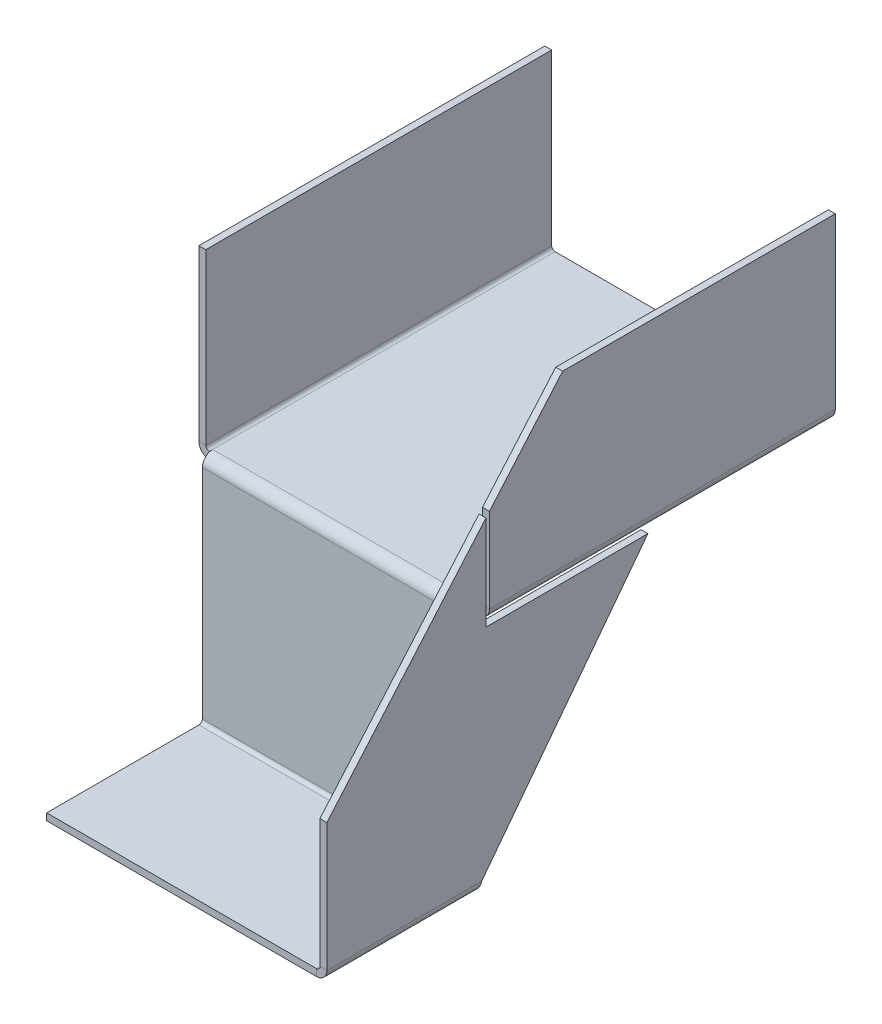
ISO-10303-21;
HEADER;
FILE_DESCRIPTION(('STEP AP214'),'2;1');
FILE_NAME('part.step','',(''),(''),'','','');
FILE_SCHEMA(('AUTOMOTIVE_DESIGN { 1 0 10303 214 1 1 1 1 }'));
ENDSEC;
DATA;
#1=APPLICATION_CONTEXT('core data for automotive mechanical design processes');
#2=APPLICATION_PROTOCOL_DEFINITION('international standard','automotive_design',2000,#1);
#3=PRODUCT_CONTEXT('',#1,'mechanical');
#4=PRODUCT('Part','Part','',(#3));
#5=PRODUCT_RELATED_PRODUCT_CATEGORY('part','',(#4));
#6=PRODUCT_DEFINITION_FORMATION('','',#4);
#7=PRODUCT_DEFINITION_CONTEXT('part definition',#1,'design');
#8=PRODUCT_DEFINITION('design','',#6,#7);
#9=PRODUCT_DEFINITION_SHAPE('','',#8);
#10=(LENGTH_UNIT() NAMED_UNIT(*) SI_UNIT(.MILLI.,.METRE.));
#11=(NAMED_UNIT(*) PLANE_ANGLE_UNIT() SI_UNIT($,.RADIAN.));
#12=(NAMED_UNIT(*) SI_UNIT($,.STERADIAN.) SOLID_ANGLE_UNIT());
#13=UNCERTAINTY_MEASURE_WITH_UNIT(LENGTH_MEASURE(1.E-05),#10,'distance_accuracy_value','');
#14=(GEOMETRIC_REPRESENTATION_CONTEXT(3) GLOBAL_UNCERTAINTY_ASSIGNED_CONTEXT((#13)) GLOBAL_UNIT_ASSIGNED_CONTEXT((#10,
#11,#12)) REPRESENTATION_CONTEXT('',''));
#15=CARTESIAN_POINT('',(0.,0.,0.));
#16=DIRECTION('',(0.,0.,1.));
#17=DIRECTION('',(1.,0.,0.));
#18=AXIS2_PLACEMENT_3D('',#15,#16,#17);
#19=CARTESIAN_POINT('',(39.,-2.,100.));
#20=DIRECTION('',(0.,0.,1.));
#21=DIRECTION('',(1.,0.,0.));
#22=AXIS2_PLACEMENT_3D('',#19,#20,#21);
#23=PLANE('',#22);
#24=DIRECTION('',(0.,1.,0.));
#25=VECTOR('',#24,1.);
#26=CARTESIAN_POINT('',(42.,0.,100.));
#27=LINE('',#26,#25);
#28=CARTESIAN_POINT('',(42.,1.,100.));
#29=VERTEX_POINT('',#28);
#30=CARTESIAN_POINT('',(42.,25.4909445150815,100.));
#31=VERTEX_POINT('',#30);
#32=EDGE_CURVE('E277',#29,#31,#27,.T.);
#33=ORIENTED_EDGE('',*,*,#32,.T.);
#34=DIRECTION('',(1.,0.,0.));
#35=VECTOR('',#34,1.);
#36=CARTESIAN_POINT('',(42.,25.4909445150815,100.));
#37=LINE('',#36,#35);
#38=CARTESIAN_POINT('',(40.,25.4909445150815,100.));
#39=VERTEX_POINT('',#38);
#40=EDGE_CURVE('E264',#31,#39,#37,.F.);
#41=ORIENTED_EDGE('',*,*,#40,.T.);
#42=DIRECTION('',(0.,1.,0.));
#43=VECTOR('',#42,1.);
#44=CARTESIAN_POINT('',(40.,0.,100.));
#45=LINE('',#44,#43);
#46=CARTESIAN_POINT('',(40.,1.,100.));
#47=VERTEX_POINT('',#46);
#48=EDGE_CURVE('E274',#47,#39,#45,.T.);
#49=ORIENTED_EDGE('',*,*,#48,.F.);
#50=DIRECTION('',(1.,0.,0.));
#51=VECTOR('',#50,1.);
#52=CARTESIAN_POINT('',(40.,1.,100.));
#53=LINE('',#52,#51);
#54=EDGE_CURVE('E387',#47,#29,#53,.T.);
#55=ORIENTED_EDGE('',*,*,#54,.T.);
#56=EDGE_LOOP('',(#33,#41,#49,#55));
#57=FACE_BOUND('',#56,.T.);
#58=ADVANCED_FACE('F65',(#57),#23,.T.);
#59=CARTESIAN_POINT('',(42.,0.,100.));
#60=DIRECTION('',(-1.,0.,0.));
#61=DIRECTION('',(0.,-1.,0.));
#62=AXIS2_PLACEMENT_3D('',#59,#60,#61);
#63=PLANE('',#62);
#64=DIRECTION('',(0.,0.756916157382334,-0.653511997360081));
#65=VECTOR('',#64,1.);
#66=CARTESIAN_POINT('',(42.,50.,78.8391862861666));
#67=LINE('',#66,#65);
#68=CARTESIAN_POINT('',(42.,50.,78.8391862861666));
#69=VERTEX_POINT('',#68);
#70=EDGE_CURVE('E269',#31,#69,#67,.T.);
#71=ORIENTED_EDGE('',*,*,#70,.F.);
#72=ORIENTED_EDGE('',*,*,#32,.F.);
#73=DIRECTION('',(0.,0.,-1.));
#74=VECTOR('',#73,1.);
#75=CARTESIAN_POINT('',(42.,1.,100.));
#76=LINE('',#75,#74);
#77=CARTESIAN_POINT('',(42.,1.,0.));
#78=VERTEX_POINT('',#77);
#79=EDGE_CURVE('E309',#29,#78,#76,.T.);
#80=ORIENTED_EDGE('',*,*,#79,.T.);
#81=DIRECTION('',(0.,1.,0.));
#82=VECTOR('',#81,1.);
#83=CARTESIAN_POINT('',(42.,0.,0.));
#84=LINE('',#83,#82);
#85=CARTESIAN_POINT('',(42.,50.,0.));
#86=VERTEX_POINT('',#85);
#87=EDGE_CURVE('E310',#78,#86,#84,.T.);
#88=ORIENTED_EDGE('',*,*,#87,.T.);
#89=DIRECTION('',(0.,0.,-1.));
#90=VECTOR('',#89,1.);
#91=CARTESIAN_POINT('',(42.,50.,100.));
#92=LINE('',#91,#90);
#93=EDGE_CURVE('E376',#69,#86,#92,.T.);
#94=ORIENTED_EDGE('',*,*,#93,.F.);
#95=EDGE_LOOP('',(#71,#72,#80,#88,#94));
#96=FACE_BOUND('',#95,.T.);
#97=ADVANCED_FACE('F567',(#96),#63,.F.);
#98=CARTESIAN_POINT('',(40.,50.,100.));
#99=DIRECTION('',(0.,1.,0.));
#100=DIRECTION('',(0.,0.,1.));
#101=AXIS2_PLACEMENT_3D('',#98,#99,#100);
#102=PLANE('',#101);
#103=DIRECTION('',(0.,0.,-1.));
#104=VECTOR('',#103,1.);
#105=CARTESIAN_POINT('',(40.,50.,100.));
#106=LINE('',#105,#104);
#107=CARTESIAN_POINT('',(40.,50.,78.8391862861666));
#108=VERTEX_POINT('',#107);
#109=CARTESIAN_POINT('',(40.,50.,0.));
#110=VERTEX_POINT('',#109);
#111=EDGE_CURVE('E374',#108,#110,#106,.T.);
#112=ORIENTED_EDGE('',*,*,#111,.F.);
#113=DIRECTION('',(1.,0.,0.));
#114=VECTOR('',#113,1.);
#115=CARTESIAN_POINT('',(42.,50.,78.8391862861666));
#116=LINE('',#115,#114);
#117=EDGE_CURVE('E82',#69,#108,#116,.F.);
#118=ORIENTED_EDGE('',*,*,#117,.F.);
#119=ORIENTED_EDGE('',*,*,#93,.T.);
#120=DIRECTION('',(1.,0.,0.));
#121=VECTOR('',#120,1.);
#122=CARTESIAN_POINT('',(40.,50.,0.));
#123=LINE('',#122,#121);
#124=EDGE_CURVE('E313',#110,#86,#123,.T.);
#125=ORIENTED_EDGE('',*,*,#124,.F.);
#126=EDGE_LOOP('',(#112,#118,#119,#125));
#127=FACE_BOUND('',#126,.T.);
#128=ADVANCED_FACE('F572',(#127),#102,.T.);
#129=CARTESIAN_POINT('',(40.,0.,100.));
#130=DIRECTION('',(-1.,0.,0.));
#131=DIRECTION('',(0.,-1.,0.));
#132=AXIS2_PLACEMENT_3D('',#129,#130,#131);
#133=PLANE('',#132);
#134=ORIENTED_EDGE('',*,*,#48,.T.);
#135=DIRECTION('',(0.,0.756916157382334,-0.653511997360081));
#136=VECTOR('',#135,1.);
#137=CARTESIAN_POINT('',(40.,50.,78.8391862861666));
#138=LINE('',#137,#136);
#139=EDGE_CURVE('E261',#39,#108,#138,.T.);
#140=ORIENTED_EDGE('',*,*,#139,.T.);
#141=ORIENTED_EDGE('',*,*,#111,.T.);
#142=DIRECTION('',(0.,1.,0.));
#143=VECTOR('',#142,1.);
#144=CARTESIAN_POINT('',(40.,0.,0.));
#145=LINE('',#144,#143);
#146=CARTESIAN_POINT('',(40.,1.,0.));
#147=VERTEX_POINT('',#146);
#148=EDGE_CURVE('E317',#147,#110,#145,.T.);
#149=ORIENTED_EDGE('',*,*,#148,.F.);
#150=DIRECTION('',(0.,0.,-1.));
#151=VECTOR('',#150,1.);
#152=CARTESIAN_POINT('',(40.,1.,100.));
#153=LINE('',#152,#151);
#154=EDGE_CURVE('E284',#47,#147,#153,.T.);
#155=ORIENTED_EDGE('',*,*,#154,.F.);
#156=EDGE_LOOP('',(#134,#140,#141,#149,#155));
#157=FACE_BOUND('',#156,.T.);
#158=ADVANCED_FACE('F281',(#157),#133,.T.);
#159=CARTESIAN_POINT('',(39.,-67.,102.));
#160=DIRECTION('',(1.,0.,0.));
#161=DIRECTION('',(0.,0.,-1.));
#162=AXIS2_PLACEMENT_3D('',#159,#160,#161);
#163=PLANE('',#162);
#164=DIRECTION('',(0.,-1.,0.));
#165=VECTOR('',#164,1.);
#166=CARTESIAN_POINT('',(39.,-67.,102.));
#167=LINE('',#166,#165);
#168=CARTESIAN_POINT('',(39.,-2.99999999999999,102.));
#169=VERTEX_POINT('',#168);
#170=CARTESIAN_POINT('',(39.,-66.,102.));
#171=VERTEX_POINT('',#170);
#172=EDGE_CURVE('E437',#169,#171,#167,.T.);
#173=ORIENTED_EDGE('',*,*,#172,.T.);
#174=DIRECTION('',(0.,0.,-1.));
#175=VECTOR('',#174,1.);
#176=CARTESIAN_POINT('',(39.,-66.,102.));
#177=LINE('',#176,#175);
#178=CARTESIAN_POINT('',(39.,-66.,100.));
#179=VERTEX_POINT('',#178);
#180=EDGE_CURVE('E467',#171,#179,#177,.T.);
#181=ORIENTED_EDGE('',*,*,#180,.T.);
#182=DIRECTION('',(0.,-1.,0.));
#183=VECTOR('',#182,1.);
#184=CARTESIAN_POINT('',(39.,-67.,100.));
#185=LINE('',#184,#183);
#186=CARTESIAN_POINT('',(39.,-3.,100.));
#187=VERTEX_POINT('',#186);
#188=EDGE_CURVE('E444',#187,#179,#185,.T.);
#189=ORIENTED_EDGE('',*,*,#188,.F.);
#190=DIRECTION('',(0.,0.,1.));
#191=VECTOR('',#190,1.);
#192=CARTESIAN_POINT('',(39.,-3.,100.));
#193=LINE('',#192,#191);
#194=EDGE_CURVE('E457',#187,#169,#193,.T.);
#195=ORIENTED_EDGE('',*,*,#194,.T.);
#196=EDGE_LOOP('',(#173,#181,#189,#195));
#197=FACE_BOUND('',#196,.T.);
#198=ADVANCED_FACE('F804',(#197),#163,.T.);
#199=CARTESIAN_POINT('',(-39.,-1.99999999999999,102.));
#200=DIRECTION('',(0.,0.,1.));
#201=DIRECTION('',(0.,-1.,0.));
#202=AXIS2_PLACEMENT_3D('',#199,#200,#201);
#203=PLANE('',#202);
#204=DIRECTION('',(0.,1.,0.));
#205=VECTOR('',#204,1.);
#206=CARTESIAN_POINT('',(-39.,-1.99999999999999,102.));
#207=LINE('',#206,#205);
#208=CARTESIAN_POINT('',(-39.,-66.,102.));
#209=VERTEX_POINT('',#208);
#210=CARTESIAN_POINT('',(-39.,-3.,102.));
#211=VERTEX_POINT('',#210);
#212=EDGE_CURVE('E434',#209,#211,#207,.T.);
#213=ORIENTED_EDGE('',*,*,#212,.F.);
#214=DIRECTION('',(1.,0.,0.));
#215=VECTOR('',#214,1.);
#216=CARTESIAN_POINT('',(39.,-66.,102.));
#217=LINE('',#216,#215);
#218=EDGE_CURVE('E478',#171,#209,#217,.F.);
#219=ORIENTED_EDGE('',*,*,#218,.F.);
#220=ORIENTED_EDGE('',*,*,#172,.F.);
#221=DIRECTION('',(-1.,0.,0.));
#222=VECTOR('',#221,1.);
#223=CARTESIAN_POINT('',(-39.,-3.,102.));
#224=LINE('',#223,#222);
#225=EDGE_CURVE('E447',#169,#211,#224,.T.);
#226=ORIENTED_EDGE('',*,*,#225,.T.);
#227=EDGE_LOOP('',(#213,#219,#220,#226));
#228=FACE_BOUND('',#227,.T.);
#229=ADVANCED_FACE('F812',(#228),#203,.T.);
#230=CARTESIAN_POINT('',(-39.,-2.,100.));
#231=DIRECTION('',(0.,0.,1.));
#232=DIRECTION('',(0.,-1.,0.));
#233=AXIS2_PLACEMENT_3D('',#230,#231,#232);
#234=PLANE('',#233);
#235=DIRECTION('',(1.,0.,0.));
#236=VECTOR('',#235,1.);
#237=CARTESIAN_POINT('',(39.,-66.,100.));
#238=LINE('',#237,#236);
#239=CARTESIAN_POINT('',(-39.,-66.,100.));
#240=VERTEX_POINT('',#239);
#241=EDGE_CURVE('E454',#179,#240,#238,.F.);
#242=ORIENTED_EDGE('',*,*,#241,.T.);
#243=DIRECTION('',(0.,1.,0.));
#244=VECTOR('',#243,1.);
#245=CARTESIAN_POINT('',(-39.,-2.,100.));
#246=LINE('',#245,#244);
#247=CARTESIAN_POINT('',(-39.,-3.,100.));
#248=VERTEX_POINT('',#247);
#249=EDGE_CURVE('E440',#240,#248,#246,.T.);
#250=ORIENTED_EDGE('',*,*,#249,.T.);
#251=DIRECTION('',(-1.,0.,0.));
#252=VECTOR('',#251,1.);
#253=CARTESIAN_POINT('',(39.,-3.,100.));
#254=LINE('',#253,#252);
#255=EDGE_CURVE('E451',#187,#248,#254,.T.);
#256=ORIENTED_EDGE('',*,*,#255,.F.);
#257=ORIENTED_EDGE('',*,*,#188,.T.);
#258=EDGE_LOOP('',(#242,#250,#256,#257));
#259=FACE_BOUND('',#258,.T.);
#260=ADVANCED_FACE('F450',(#259),#234,.F.);
#261=CARTESIAN_POINT('',(-39.,-2.,100.));
#262=DIRECTION('',(1.,0.,0.));
#263=DIRECTION('',(0.,0.,-1.));
#264=AXIS2_PLACEMENT_3D('',#261,#262,#263);
#265=PLANE('',#264);
#266=DIRECTION('',(0.,-1.,0.));
#267=VECTOR('',#266,1.);
#268=CARTESIAN_POINT('',(-39.,0.,100.));
#269=LINE('',#268,#267);
#270=CARTESIAN_POINT('',(-39.,0.,100.));
#271=VERTEX_POINT('',#270);
#272=CARTESIAN_POINT('',(-39.,-0.171572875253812,100.));
#273=VERTEX_POINT('',#272);
#274=EDGE_CURVE('E69',#271,#273,#269,.T.);
#275=ORIENTED_EDGE('',*,*,#274,.T.);
#276=CARTESIAN_POINT('',(-39.,-3.,99.));
#277=DIRECTION('',(-1.,0.,0.));
#278=DIRECTION('',(0.,0.,1.));
#279=AXIS2_PLACEMENT_3D('',#276,#277,#278);
#280=CIRCLE('',#279,3.);
#281=CARTESIAN_POINT('',(-39.,0.,99.));
#282=VERTEX_POINT('',#281);
#283=EDGE_CURVE('E13',#273,#282,#280,.T.);
#284=ORIENTED_EDGE('',*,*,#283,.T.);
#285=DIRECTION('',(0.,0.,-1.));
#286=VECTOR('',#285,1.);
#287=CARTESIAN_POINT('',(-39.,0.,100.));
#288=LINE('',#287,#286);
#289=EDGE_CURVE('E367',#271,#282,#288,.T.);
#290=ORIENTED_EDGE('',*,*,#289,.F.);
#291=EDGE_LOOP('',(#275,#284,#290));
#292=FACE_BOUND('',#291,.T.);
#293=ADVANCED_FACE('F405',(#292),#265,.T.);
#294=CARTESIAN_POINT('',(39.,-2.,99.));
#295=DIRECTION('',(-1.,0.,0.));
#296=DIRECTION('',(0.,0.,1.));
#297=AXIS2_PLACEMENT_3D('',#294,#295,#296);
#298=PLANE('',#297);
#299=DIRECTION('',(0.,0.,-1.));
#300=VECTOR('',#299,1.);
#301=CARTESIAN_POINT('',(39.,0.,100.));
#302=LINE('',#301,#300);
#303=CARTESIAN_POINT('',(39.,0.,100.));
#304=VERTEX_POINT('',#303);
#305=CARTESIAN_POINT('',(39.,0.,99.));
#306=VERTEX_POINT('',#305);
#307=EDGE_CURVE('E371',#304,#306,#302,.T.);
#308=ORIENTED_EDGE('',*,*,#307,.T.);
#309=CARTESIAN_POINT('',(39.,-3.,99.));
#310=DIRECTION('',(-1.,0.,0.));
#311=DIRECTION('',(0.,0.,1.));
#312=AXIS2_PLACEMENT_3D('',#309,#310,#311);
#313=CIRCLE('',#312,3.);
#314=CARTESIAN_POINT('',(39.,-0.171572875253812,100.));
#315=VERTEX_POINT('',#314);
#316=EDGE_CURVE('E314',#306,#315,#313,.F.);
#317=ORIENTED_EDGE('',*,*,#316,.T.);
#318=DIRECTION('',(0.,1.,0.));
#319=VECTOR('',#318,1.);
#320=CARTESIAN_POINT('',(39.,-2.,100.));
#321=LINE('',#320,#319);
#322=EDGE_CURVE('E383',#315,#304,#321,.T.);
#323=ORIENTED_EDGE('',*,*,#322,.T.);
#324=EDGE_LOOP('',(#308,#317,#323));
#325=FACE_BOUND('',#324,.T.);
#326=ADVANCED_FACE('F834',(#325),#298,.T.);
#327=CARTESIAN_POINT('',(-40.,0.,100.));
#328=DIRECTION('',(0.,1.,0.));
#329=DIRECTION('',(0.,0.,1.));
#330=AXIS2_PLACEMENT_3D('',#327,#328,#329);
#331=PLANE('',#330);
#332=CARTESIAN_POINT('',(-39.,0.,0.));
#333=VERTEX_POINT('',#332);
#334=EDGE_CURVE('E366',#282,#333,#288,.T.);
#335=ORIENTED_EDGE('',*,*,#334,.F.);
#336=DIRECTION('',(-1.,0.,0.));
#337=VECTOR('',#336,1.);
#338=CARTESIAN_POINT('',(-39.,0.,99.));
#339=LINE('',#338,#337);
#340=EDGE_CURVE('E417',#282,#306,#339,.F.);
#341=ORIENTED_EDGE('',*,*,#340,.T.);
#342=CARTESIAN_POINT('',(39.,0.,0.));
#343=VERTEX_POINT('',#342);
#344=EDGE_CURVE('E370',#306,#343,#302,.T.);
#345=ORIENTED_EDGE('',*,*,#344,.T.);
#346=DIRECTION('',(1.,0.,0.));
#347=VECTOR('',#346,1.);
#348=CARTESIAN_POINT('',(-40.,0.,0.));
#349=LINE('',#348,#347);
#350=EDGE_CURVE('E323',#333,#343,#349,.T.);
#351=ORIENTED_EDGE('',*,*,#350,.F.);
#352=EDGE_LOOP('',(#335,#341,#345,#351));
#353=FACE_BOUND('',#352,.T.);
#354=ADVANCED_FACE('F622',(#353),#331,.T.);
#355=CARTESIAN_POINT('',(-40.,-2.,100.));
#356=DIRECTION('',(0.,1.,0.));
#357=DIRECTION('',(0.,0.,1.));
#358=AXIS2_PLACEMENT_3D('',#355,#356,#357);
#359=PLANE('',#358);
#360=DIRECTION('',(-1.,0.,0.));
#361=VECTOR('',#360,1.);
#362=CARTESIAN_POINT('',(-39.,-2.,99.));
#363=LINE('',#362,#361);
#364=CARTESIAN_POINT('',(-39.,-2.,99.));
#365=VERTEX_POINT('',#364);
#366=CARTESIAN_POINT('',(39.,-2.,99.));
#367=VERTEX_POINT('',#366);
#368=EDGE_CURVE('E427',#365,#367,#363,.F.);
#369=ORIENTED_EDGE('',*,*,#368,.F.);
#370=DIRECTION('',(0.,0.,-1.));
#371=VECTOR('',#370,1.);
#372=CARTESIAN_POINT('',(-39.,-2.,100.));
#373=LINE('',#372,#371);
#374=CARTESIAN_POINT('',(-39.,-2.,0.));
#375=VERTEX_POINT('',#374);
#376=EDGE_CURVE('E352',#365,#375,#373,.T.);
#377=ORIENTED_EDGE('',*,*,#376,.T.);
#378=DIRECTION('',(1.,0.,0.));
#379=VECTOR('',#378,1.);
#380=CARTESIAN_POINT('',(-40.,-2.,0.));
#381=LINE('',#380,#379);
#382=CARTESIAN_POINT('',(39.,-2.,0.));
#383=VERTEX_POINT('',#382);
#384=EDGE_CURVE('E341',#375,#383,#381,.T.);
#385=ORIENTED_EDGE('',*,*,#384,.T.);
#386=DIRECTION('',(0.,0.,-1.));
#387=VECTOR('',#386,1.);
#388=CARTESIAN_POINT('',(39.,-2.,100.));
#389=LINE('',#388,#387);
#390=EDGE_CURVE('E348',#367,#383,#389,.T.);
#391=ORIENTED_EDGE('',*,*,#390,.F.);
#392=EDGE_LOOP('',(#369,#377,#385,#391));
#393=FACE_BOUND('',#392,.T.);
#394=ADVANCED_FACE('F592',(#393),#359,.F.);
#395=CARTESIAN_POINT('',(-39.,0.,100.));
#396=DIRECTION('',(0.,0.,1.));
#397=DIRECTION('',(1.,0.,0.));
#398=AXIS2_PLACEMENT_3D('',#395,#396,#397);
#399=PLANE('',#398);
#400=ORIENTED_EDGE('',*,*,#274,.F.);
#401=CARTESIAN_POINT('',(-39.,1.,100.));
#402=DIRECTION('',(0.,0.,-1.));
#403=DIRECTION('',(-1.,0.,0.));
#404=AXIS2_PLACEMENT_3D('',#401,#402,#403);
#405=CIRCLE('',#404,1.);
#406=CARTESIAN_POINT('',(-40.,1.,100.));
#407=VERTEX_POINT('',#406);
#408=EDGE_CURVE('E287',#407,#271,#405,.F.);
#409=ORIENTED_EDGE('',*,*,#408,.F.);
#410=DIRECTION('',(1.,0.,0.));
#411=VECTOR('',#410,1.);
#412=CARTESIAN_POINT('',(-42.,1.,100.));
#413=LINE('',#412,#411);
#414=CARTESIAN_POINT('',(-42.,1.,100.));
#415=VERTEX_POINT('',#414);
#416=EDGE_CURVE('E393',#415,#407,#413,.T.);
#417=ORIENTED_EDGE('',*,*,#416,.F.);
#418=CARTESIAN_POINT('',(-39.,1.,100.));
#419=DIRECTION('',(0.,0.,1.));
#420=DIRECTION('',(1.,0.,0.));
#421=AXIS2_PLACEMENT_3D('',#418,#419,#420);
#422=CIRCLE('',#421,3.);
#423=CARTESIAN_POINT('',(-39.,-2.,100.));
#424=VERTEX_POINT('',#423);
#425=EDGE_CURVE('E304',#415,#424,#422,.T.);
#426=ORIENTED_EDGE('',*,*,#425,.T.);
#427=EDGE_CURVE('E394',#273,#424,#269,.T.);
#428=ORIENTED_EDGE('',*,*,#427,.F.);
#429=EDGE_LOOP('',(#400,#409,#417,#426,#428));
#430=FACE_BOUND('',#429,.T.);
#431=ADVANCED_FACE('F67',(#430),#399,.T.);
#432=CARTESIAN_POINT('',(-40.,1.,0.));
#433=DIRECTION('',(0.,0.,-1.));
#434=DIRECTION('',(-1.,0.,0.));
#435=AXIS2_PLACEMENT_3D('',#432,#433,#434);
#436=PLANE('',#435);
#437=DIRECTION('',(-1.,0.,0.));
#438=VECTOR('',#437,1.);
#439=CARTESIAN_POINT('',(-40.,1.,0.));
#440=LINE('',#439,#438);
#441=CARTESIAN_POINT('',(-40.,1.,0.));
#442=VERTEX_POINT('',#441);
#443=CARTESIAN_POINT('',(-42.,1.,0.));
#444=VERTEX_POINT('',#443);
#445=EDGE_CURVE('E392',#442,#444,#440,.T.);
#446=ORIENTED_EDGE('',*,*,#445,.F.);
#447=CARTESIAN_POINT('',(-39.,1.,0.));
#448=DIRECTION('',(0.,0.,-1.));
#449=DIRECTION('',(-1.,0.,0.));
#450=AXIS2_PLACEMENT_3D('',#447,#448,#449);
#451=CIRCLE('',#450,1.);
#452=EDGE_CURVE('E326',#442,#333,#451,.F.);
#453=ORIENTED_EDGE('',*,*,#452,.T.);
#454=DIRECTION('',(0.,1.,0.));
#455=VECTOR('',#454,1.);
#456=CARTESIAN_POINT('',(-39.,-2.,0.));
#457=LINE('',#456,#455);
#458=EDGE_CURVE('E389',#375,#333,#457,.T.);
#459=ORIENTED_EDGE('',*,*,#458,.F.);
#460=CARTESIAN_POINT('',(-39.,1.,0.));
#461=DIRECTION('',(0.,0.,1.));
#462=DIRECTION('',(1.,0.,0.));
#463=AXIS2_PLACEMENT_3D('',#460,#461,#462);
#464=CIRCLE('',#463,3.);
#465=EDGE_CURVE('E338',#444,#375,#464,.T.);
#466=ORIENTED_EDGE('',*,*,#465,.F.);
#467=EDGE_LOOP('',(#446,#453,#459,#466));
#468=FACE_BOUND('',#467,.T.);
#469=ADVANCED_FACE('F585',(#468),#436,.T.);
#470=CARTESIAN_POINT('',(-39.,-2.,0.));
#471=DIRECTION('',(0.,0.,-1.));
#472=DIRECTION('',(-1.,0.,0.));
#473=AXIS2_PLACEMENT_3D('',#470,#471,#472);
#474=PLANE('',#473);
#475=DIRECTION('',(0.,-1.,0.));
#476=VECTOR('',#475,1.);
#477=CARTESIAN_POINT('',(-40.,50.,0.));
#478=LINE('',#477,#476);
#479=CARTESIAN_POINT('',(-40.,50.,0.));
#480=VERTEX_POINT('',#479);
#481=EDGE_CURVE('E329',#480,#442,#478,.T.);
#482=ORIENTED_EDGE('',*,*,#481,.T.);
#483=ORIENTED_EDGE('',*,*,#445,.T.);
#484=DIRECTION('',(0.,-1.,0.));
#485=VECTOR('',#484,1.);
#486=CARTESIAN_POINT('',(-42.,50.,0.));
#487=LINE('',#486,#485);
#488=CARTESIAN_POINT('',(-42.,50.,0.));
#489=VERTEX_POINT('',#488);
#490=EDGE_CURVE('E335',#489,#444,#487,.T.);
#491=ORIENTED_EDGE('',*,*,#490,.F.);
#492=DIRECTION('',(1.,0.,0.));
#493=VECTOR('',#492,1.);
#494=CARTESIAN_POINT('',(-42.,50.,0.));
#495=LINE('',#494,#493);
#496=EDGE_CURVE('E332',#489,#480,#495,.T.);
#497=ORIENTED_EDGE('',*,*,#496,.T.);
#498=EDGE_LOOP('',(#482,#483,#491,#497));
#499=FACE_BOUND('',#498,.T.);
#500=ADVANCED_FACE('F582',(#499),#474,.T.);
#501=CARTESIAN_POINT('',(40.,1.,100.));
#502=DIRECTION('',(0.,0.,1.));
#503=DIRECTION('',(1.,0.,0.));
#504=AXIS2_PLACEMENT_3D('',#501,#502,#503);
#505=PLANE('',#504);
#506=ORIENTED_EDGE('',*,*,#54,.F.);
#507=CARTESIAN_POINT('',(39.,1.,100.));
#508=DIRECTION('',(0.,0.,-1.));
#509=DIRECTION('',(-1.,0.,0.));
#510=AXIS2_PLACEMENT_3D('',#507,#508,#509);
#511=CIRCLE('',#510,1.);
#512=EDGE_CURVE('E285',#304,#47,#511,.F.);
#513=ORIENTED_EDGE('',*,*,#512,.F.);
#514=ORIENTED_EDGE('',*,*,#322,.F.);
#515=CARTESIAN_POINT('',(39.,-2.,100.));
#516=VERTEX_POINT('',#515);
#517=EDGE_CURVE('E384',#516,#315,#321,.T.);
#518=ORIENTED_EDGE('',*,*,#517,.F.);
#519=CARTESIAN_POINT('',(39.,1.,100.));
#520=DIRECTION('',(0.,0.,1.));
#521=DIRECTION('',(1.,0.,0.));
#522=AXIS2_PLACEMENT_3D('',#519,#520,#521);
#523=CIRCLE('',#522,3.);
#524=EDGE_CURVE('E306',#516,#29,#523,.T.);
#525=ORIENTED_EDGE('',*,*,#524,.T.);
#526=EDGE_LOOP('',(#506,#513,#514,#518,#525));
#527=FACE_BOUND('',#526,.T.);
#528=ADVANCED_FACE('F579',(#527),#505,.T.);
#529=CARTESIAN_POINT('',(39.,0.,0.));
#530=DIRECTION('',(0.,0.,-1.));
#531=DIRECTION('',(-1.,0.,0.));
#532=AXIS2_PLACEMENT_3D('',#529,#530,#531);
#533=PLANE('',#532);
#534=DIRECTION('',(0.,-1.,0.));
#535=VECTOR('',#534,1.);
#536=CARTESIAN_POINT('',(39.,0.,0.));
#537=LINE('',#536,#535);
#538=EDGE_CURVE('E380',#343,#383,#537,.T.);
#539=ORIENTED_EDGE('',*,*,#538,.F.);
#540=CARTESIAN_POINT('',(39.,1.,0.));
#541=DIRECTION('',(0.,0.,-1.));
#542=DIRECTION('',(-1.,0.,0.));
#543=AXIS2_PLACEMENT_3D('',#540,#541,#542);
#544=CIRCLE('',#543,1.);
#545=EDGE_CURVE('E320',#343,#147,#544,.F.);
#546=ORIENTED_EDGE('',*,*,#545,.T.);
#547=DIRECTION('',(-1.,0.,0.));
#548=VECTOR('',#547,1.);
#549=CARTESIAN_POINT('',(42.,1.,0.));
#550=LINE('',#549,#548);
#551=EDGE_CURVE('E378',#78,#147,#550,.T.);
#552=ORIENTED_EDGE('',*,*,#551,.F.);
#553=CARTESIAN_POINT('',(39.,1.,0.));
#554=DIRECTION('',(0.,0.,1.));
#555=DIRECTION('',(1.,0.,0.));
#556=AXIS2_PLACEMENT_3D('',#553,#554,#555);
#557=CIRCLE('',#556,3.);
#558=EDGE_CURVE('E289',#383,#78,#557,.T.);
#559=ORIENTED_EDGE('',*,*,#558,.F.);
#560=EDGE_LOOP('',(#539,#546,#552,#559));
#561=FACE_BOUND('',#560,.T.);
#562=ADVANCED_FACE('F577',(#561),#533,.T.);
#563=CARTESIAN_POINT('',(42.,1.,0.));
#564=DIRECTION('',(0.,0.,-1.));
#565=DIRECTION('',(-1.,0.,0.));
#566=AXIS2_PLACEMENT_3D('',#563,#564,#565);
#567=PLANE('',#566);
#568=ORIENTED_EDGE('',*,*,#350,.T.);
#569=ORIENTED_EDGE('',*,*,#538,.T.);
#570=ORIENTED_EDGE('',*,*,#384,.F.);
#571=ORIENTED_EDGE('',*,*,#458,.T.);
#572=EDGE_LOOP('',(#568,#569,#570,#571));
#573=FACE_BOUND('',#572,.T.);
#574=ADVANCED_FACE('F620',(#573),#567,.T.);
#575=CARTESIAN_POINT('',(39.,1.,100.));
#576=DIRECTION('',(0.,0.,-1.));
#577=DIRECTION('',(-1.,0.,0.));
#578=AXIS2_PLACEMENT_3D('',#575,#576,#577);
#579=CYLINDRICAL_SURFACE('',#578,1.);
#580=ORIENTED_EDGE('',*,*,#545,.F.);
#581=ORIENTED_EDGE('',*,*,#344,.F.);
#582=ORIENTED_EDGE('',*,*,#307,.F.);
#583=ORIENTED_EDGE('',*,*,#512,.T.);
#584=ORIENTED_EDGE('',*,*,#154,.T.);
#585=EDGE_LOOP('',(#580,#581,#582,#583,#584));
#586=FACE_BOUND('',#585,.T.);
#587=ADVANCED_FACE('F629',(#586),#579,.F.);
#588=CARTESIAN_POINT('',(-39.,1.,100.));
#589=DIRECTION('',(0.,0.,-1.));
#590=DIRECTION('',(-1.,0.,0.));
#591=AXIS2_PLACEMENT_3D('',#588,#589,#590);
#592=CYLINDRICAL_SURFACE('',#591,1.);
#593=ORIENTED_EDGE('',*,*,#452,.F.);
#594=DIRECTION('',(0.,0.,-1.));
#595=VECTOR('',#594,1.);
#596=CARTESIAN_POINT('',(-40.,1.,100.));
#597=LINE('',#596,#595);
#598=EDGE_CURVE('E363',#407,#442,#597,.T.);
#599=ORIENTED_EDGE('',*,*,#598,.F.);
#600=ORIENTED_EDGE('',*,*,#408,.T.);
#601=ORIENTED_EDGE('',*,*,#289,.T.);
#602=ORIENTED_EDGE('',*,*,#334,.T.);
#603=EDGE_LOOP('',(#593,#599,#600,#601,#602));
#604=FACE_BOUND('',#603,.T.);
#605=ADVANCED_FACE('F601',(#604),#592,.F.);
#606=CARTESIAN_POINT('',(-40.,50.,100.));
#607=DIRECTION('',(1.,0.,0.));
#608=DIRECTION('',(0.,1.,0.));
#609=AXIS2_PLACEMENT_3D('',#606,#607,#608);
#610=PLANE('',#609);
#611=ORIENTED_EDGE('',*,*,#481,.F.);
#612=DIRECTION('',(0.,0.,-1.));
#613=VECTOR('',#612,1.);
#614=CARTESIAN_POINT('',(-40.,50.,100.));
#615=LINE('',#614,#613);
#616=CARTESIAN_POINT('',(-40.,50.,100.));
#617=VERTEX_POINT('',#616);
#618=EDGE_CURVE('E361',#617,#480,#615,.T.);
#619=ORIENTED_EDGE('',*,*,#618,.F.);
#620=DIRECTION('',(0.,-1.,0.));
#621=VECTOR('',#620,1.);
#622=CARTESIAN_POINT('',(-40.,50.,100.));
#623=LINE('',#622,#621);
#624=EDGE_CURVE('E295',#617,#407,#623,.T.);
#625=ORIENTED_EDGE('',*,*,#624,.T.);
#626=ORIENTED_EDGE('',*,*,#598,.T.);
#627=EDGE_LOOP('',(#611,#619,#625,#626));
#628=FACE_BOUND('',#627,.T.);
#629=ADVANCED_FACE('F599',(#628),#610,.T.);
#630=CARTESIAN_POINT('',(-42.,50.,100.));
#631=DIRECTION('',(0.,1.,0.));
#632=DIRECTION('',(0.,0.,1.));
#633=AXIS2_PLACEMENT_3D('',#630,#631,#632);
#634=PLANE('',#633);
#635=ORIENTED_EDGE('',*,*,#496,.F.);
#636=DIRECTION('',(0.,0.,-1.));
#637=VECTOR('',#636,1.);
#638=CARTESIAN_POINT('',(-42.,50.,100.));
#639=LINE('',#638,#637);
#640=CARTESIAN_POINT('',(-42.,50.,100.));
#641=VERTEX_POINT('',#640);
#642=EDGE_CURVE('E359',#641,#489,#639,.T.);
#643=ORIENTED_EDGE('',*,*,#642,.F.);
#644=DIRECTION('',(1.,0.,0.));
#645=VECTOR('',#644,1.);
#646=CARTESIAN_POINT('',(-42.,50.,100.));
#647=LINE('',#646,#645);
#648=EDGE_CURVE('E298',#641,#617,#647,.T.);
#649=ORIENTED_EDGE('',*,*,#648,.T.);
#650=ORIENTED_EDGE('',*,*,#618,.T.);
#651=EDGE_LOOP('',(#635,#643,#649,#650));
#652=FACE_BOUND('',#651,.T.);
#653=ADVANCED_FACE('F604',(#652),#634,.T.);
#654=CARTESIAN_POINT('',(-42.,50.,100.));
#655=DIRECTION('',(1.,0.,0.));
#656=DIRECTION('',(0.,1.,0.));
#657=AXIS2_PLACEMENT_3D('',#654,#655,#656);
#658=PLANE('',#657);
#659=ORIENTED_EDGE('',*,*,#490,.T.);
#660=DIRECTION('',(0.,0.,-1.));
#661=VECTOR('',#660,1.);
#662=CARTESIAN_POINT('',(-42.,1.,100.));
#663=LINE('',#662,#661);
#664=EDGE_CURVE('E356',#415,#444,#663,.T.);
#665=ORIENTED_EDGE('',*,*,#664,.F.);
#666=DIRECTION('',(0.,-1.,0.));
#667=VECTOR('',#666,1.);
#668=CARTESIAN_POINT('',(-42.,50.,100.));
#669=LINE('',#668,#667);
#670=EDGE_CURVE('E301',#641,#415,#669,.T.);
#671=ORIENTED_EDGE('',*,*,#670,.F.);
#672=ORIENTED_EDGE('',*,*,#642,.T.);
#673=EDGE_LOOP('',(#659,#665,#671,#672));
#674=FACE_BOUND('',#673,.T.);
#675=ADVANCED_FACE('F611',(#674),#658,.F.);
#676=CARTESIAN_POINT('',(-39.,1.,100.));
#677=DIRECTION('',(0.,0.,-1.));
#678=DIRECTION('',(-1.,0.,0.));
#679=AXIS2_PLACEMENT_3D('',#676,#677,#678);
#680=CYLINDRICAL_SURFACE('',#679,3.);
#681=ORIENTED_EDGE('',*,*,#465,.T.);
#682=ORIENTED_EDGE('',*,*,#376,.F.);
#683=EDGE_CURVE('E353',#424,#365,#373,.T.);
#684=ORIENTED_EDGE('',*,*,#683,.F.);
#685=ORIENTED_EDGE('',*,*,#425,.F.);
#686=ORIENTED_EDGE('',*,*,#664,.T.);
#687=EDGE_LOOP('',(#681,#682,#684,#685,#686));
#688=FACE_BOUND('',#687,.T.);
#689=ADVANCED_FACE('F613',(#688),#680,.T.);
#690=CARTESIAN_POINT('',(39.,1.,100.));
#691=DIRECTION('',(0.,0.,-1.));
#692=DIRECTION('',(-1.,0.,0.));
#693=AXIS2_PLACEMENT_3D('',#690,#691,#692);
#694=CYLINDRICAL_SURFACE('',#693,3.);
#695=ORIENTED_EDGE('',*,*,#558,.T.);
#696=ORIENTED_EDGE('',*,*,#79,.F.);
#697=ORIENTED_EDGE('',*,*,#524,.F.);
#698=EDGE_CURVE('E349',#516,#367,#389,.T.);
#699=ORIENTED_EDGE('',*,*,#698,.T.);
#700=ORIENTED_EDGE('',*,*,#390,.T.);
#701=EDGE_LOOP('',(#695,#696,#697,#699,#700));
#702=FACE_BOUND('',#701,.T.);
#703=ADVANCED_FACE('F637',(#702),#694,.T.);
#704=CARTESIAN_POINT('',(39.,1.,100.));
#705=DIRECTION('',(0.,0.,-1.));
#706=DIRECTION('',(-1.,0.,0.));
#707=AXIS2_PLACEMENT_3D('',#704,#705,#706);
#708=PLANE('',#707);
#709=ORIENTED_EDGE('',*,*,#670,.T.);
#710=ORIENTED_EDGE('',*,*,#416,.T.);
#711=ORIENTED_EDGE('',*,*,#624,.F.);
#712=ORIENTED_EDGE('',*,*,#648,.F.);
#713=EDGE_LOOP('',(#709,#710,#711,#712));
#714=FACE_BOUND('',#713,.T.);
#715=ADVANCED_FACE('F607',(#714),#708,.F.);
#716=CARTESIAN_POINT('',(39.,1.,0.));
#717=DIRECTION('',(0.,0.,-1.));
#718=DIRECTION('',(-1.,0.,0.));
#719=AXIS2_PLACEMENT_3D('',#716,#717,#718);
#720=PLANE('',#719);
#721=ORIENTED_EDGE('',*,*,#87,.F.);
#722=ORIENTED_EDGE('',*,*,#551,.T.);
#723=ORIENTED_EDGE('',*,*,#148,.T.);
#724=ORIENTED_EDGE('',*,*,#124,.T.);
#725=EDGE_LOOP('',(#721,#722,#723,#724));
#726=FACE_BOUND('',#725,.T.);
#727=ADVANCED_FACE('F634',(#726),#720,.T.);
#728=CARTESIAN_POINT('',(39.,-3.,99.));
#729=DIRECTION('',(1.,0.,0.));
#730=DIRECTION('',(0.,0.,-1.));
#731=AXIS2_PLACEMENT_3D('',#728,#729,#730);
#732=PLANE('',#731);
#733=ORIENTED_EDGE('',*,*,#698,.F.);
#734=ORIENTED_EDGE('',*,*,#517,.T.);
#735=EDGE_CURVE('E424',#315,#169,#313,.F.);
#736=ORIENTED_EDGE('',*,*,#735,.T.);
#737=ORIENTED_EDGE('',*,*,#194,.F.);
#738=CARTESIAN_POINT('',(39.,-3.,99.));
#739=DIRECTION('',(-1.,0.,0.));
#740=DIRECTION('',(0.,0.,1.));
#741=AXIS2_PLACEMENT_3D('',#738,#739,#740);
#742=CIRCLE('',#741,1.);
#743=EDGE_CURVE('E423',#367,#187,#742,.F.);
#744=ORIENTED_EDGE('',*,*,#743,.F.);
#745=EDGE_LOOP('',(#733,#734,#736,#737,#744));
#746=FACE_BOUND('',#745,.T.);
#747=ADVANCED_FACE('F920',(#746),#732,.T.);
#748=CARTESIAN_POINT('',(-39.,-3.,99.));
#749=DIRECTION('',(1.,0.,0.));
#750=DIRECTION('',(0.,0.,-1.));
#751=AXIS2_PLACEMENT_3D('',#748,#749,#750);
#752=PLANE('',#751);
#753=EDGE_CURVE('E75',#211,#273,#280,.T.);
#754=ORIENTED_EDGE('',*,*,#753,.T.);
#755=ORIENTED_EDGE('',*,*,#427,.T.);
#756=ORIENTED_EDGE('',*,*,#683,.T.);
#757=CARTESIAN_POINT('',(-39.,-3.,99.));
#758=DIRECTION('',(-1.,0.,0.));
#759=DIRECTION('',(0.,0.,1.));
#760=AXIS2_PLACEMENT_3D('',#757,#758,#759);
#761=CIRCLE('',#760,1.);
#762=EDGE_CURVE('E432',#248,#365,#761,.T.);
#763=ORIENTED_EDGE('',*,*,#762,.F.);
#764=DIRECTION('',(0.,0.,1.));
#765=VECTOR('',#764,1.);
#766=CARTESIAN_POINT('',(-39.,-3.,100.));
#767=LINE('',#766,#765);
#768=EDGE_CURVE('E421',#248,#211,#767,.T.);
#769=ORIENTED_EDGE('',*,*,#768,.T.);
#770=EDGE_LOOP('',(#754,#755,#756,#763,#769));
#771=FACE_BOUND('',#770,.T.);
#772=ADVANCED_FACE('F418',(#771),#752,.F.);
#773=CARTESIAN_POINT('',(-39.,-3.,99.));
#774=DIRECTION('',(-1.,0.,0.));
#775=DIRECTION('',(0.,0.,1.));
#776=AXIS2_PLACEMENT_3D('',#773,#774,#775);
#777=CYLINDRICAL_SURFACE('',#776,3.);
#778=ORIENTED_EDGE('',*,*,#340,.F.);
#779=ORIENTED_EDGE('',*,*,#283,.F.);
#780=ORIENTED_EDGE('',*,*,#753,.F.);
#781=ORIENTED_EDGE('',*,*,#225,.F.);
#782=ORIENTED_EDGE('',*,*,#735,.F.);
#783=ORIENTED_EDGE('',*,*,#316,.F.);
#784=EDGE_LOOP('',(#778,#779,#780,#781,#782,#783));
#785=FACE_BOUND('',#784,.T.);
#786=ADVANCED_FACE('F412',(#785),#777,.T.);
#787=CARTESIAN_POINT('',(-39.,-3.,99.));
#788=DIRECTION('',(-1.,0.,0.));
#789=DIRECTION('',(0.,0.,1.));
#790=AXIS2_PLACEMENT_3D('',#787,#788,#789);
#791=CYLINDRICAL_SURFACE('',#790,1.);
#792=ORIENTED_EDGE('',*,*,#368,.T.);
#793=ORIENTED_EDGE('',*,*,#743,.T.);
#794=ORIENTED_EDGE('',*,*,#255,.T.);
#795=ORIENTED_EDGE('',*,*,#762,.T.);
#796=EDGE_LOOP('',(#792,#793,#794,#795));
#797=FACE_BOUND('',#796,.T.);
#798=ADVANCED_FACE('F455',(#797),#791,.F.);
#799=CARTESIAN_POINT('',(-39.,-1.99999999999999,102.));
#800=DIRECTION('',(-1.,0.,0.));
#801=DIRECTION('',(0.,0.,1.));
#802=AXIS2_PLACEMENT_3D('',#799,#800,#801);
#803=PLANE('',#802);
#804=DIRECTION('',(0.,0.,-1.));
#805=VECTOR('',#804,1.);
#806=CARTESIAN_POINT('',(-39.,-66.,102.));
#807=LINE('',#806,#805);
#808=EDGE_CURVE('E90',#209,#240,#807,.T.);
#809=ORIENTED_EDGE('',*,*,#808,.F.);
#810=ORIENTED_EDGE('',*,*,#212,.T.);
#811=ORIENTED_EDGE('',*,*,#768,.F.);
#812=ORIENTED_EDGE('',*,*,#249,.F.);
#813=EDGE_LOOP('',(#809,#810,#811,#812));
#814=FACE_BOUND('',#813,.T.);
#815=ADVANCED_FACE('F460',(#814),#803,.T.);
#816=CARTESIAN_POINT('',(-39.,-66.,103.));
#817=DIRECTION('',(-1.,0.,0.));
#818=DIRECTION('',(0.,0.,1.));
#819=AXIS2_PLACEMENT_3D('',#816,#817,#818);
#820=PLANE('',#819);
#821=DIRECTION('',(0.,-1.,0.));
#822=VECTOR('',#821,1.);
#823=CARTESIAN_POINT('',(-39.,-67.,103.));
#824=LINE('',#823,#822);
#825=CARTESIAN_POINT('',(-39.,-67.,103.));
#826=VERTEX_POINT('',#825);
#827=CARTESIAN_POINT('',(-39.,-69.,103.));
#828=VERTEX_POINT('',#827);
#829=EDGE_CURVE('E513',#826,#828,#824,.T.);
#830=ORIENTED_EDGE('',*,*,#829,.F.);
#831=CARTESIAN_POINT('',(-39.,-66.,103.));
#832=DIRECTION('',(1.,0.,0.));
#833=DIRECTION('',(0.,0.,-1.));
#834=AXIS2_PLACEMENT_3D('',#831,#832,#833);
#835=CIRCLE('',#834,1.);
#836=EDGE_CURVE('E482',#209,#826,#835,.F.);
#837=ORIENTED_EDGE('',*,*,#836,.F.);
#838=ORIENTED_EDGE('',*,*,#808,.T.);
#839=CARTESIAN_POINT('',(-39.,-66.,103.));
#840=DIRECTION('',(1.,0.,0.));
#841=DIRECTION('',(0.,0.,-1.));
#842=AXIS2_PLACEMENT_3D('',#839,#840,#841);
#843=CIRCLE('',#842,3.);
#844=EDGE_CURVE('E473',#240,#828,#843,.F.);
#845=ORIENTED_EDGE('',*,*,#844,.T.);
#846=EDGE_LOOP('',(#830,#837,#838,#845));
#847=FACE_BOUND('',#846,.T.);
#848=ADVANCED_FACE('F710',(#847),#820,.T.);
#849=CARTESIAN_POINT('',(39.,-66.,103.));
#850=DIRECTION('',(-1.,0.,0.));
#851=DIRECTION('',(0.,0.,1.));
#852=AXIS2_PLACEMENT_3D('',#849,#850,#851);
#853=PLANE('',#852);
#854=CARTESIAN_POINT('',(39.,-66.,103.));
#855=DIRECTION('',(1.,0.,0.));
#856=DIRECTION('',(0.,0.,-1.));
#857=AXIS2_PLACEMENT_3D('',#854,#855,#856);
#858=CIRCLE('',#857,1.);
#859=CARTESIAN_POINT('',(39.,-67.,103.));
#860=VERTEX_POINT('',#859);
#861=EDGE_CURVE('E475',#860,#171,#858,.T.);
#862=ORIENTED_EDGE('',*,*,#861,.F.);
#863=DIRECTION('',(0.,-1.,0.));
#864=VECTOR('',#863,1.);
#865=CARTESIAN_POINT('',(39.,-67.,103.));
#866=LINE('',#865,#864);
#867=CARTESIAN_POINT('',(39.,-69.,103.));
#868=VERTEX_POINT('',#867);
#869=EDGE_CURVE('E512',#860,#868,#866,.T.);
#870=ORIENTED_EDGE('',*,*,#869,.T.);
#871=CARTESIAN_POINT('',(39.,-66.,103.));
#872=DIRECTION('',(1.,0.,0.));
#873=DIRECTION('',(0.,0.,-1.));
#874=AXIS2_PLACEMENT_3D('',#871,#872,#873);
#875=CIRCLE('',#874,3.);
#876=EDGE_CURVE('E485',#868,#179,#875,.T.);
#877=ORIENTED_EDGE('',*,*,#876,.T.);
#878=ORIENTED_EDGE('',*,*,#180,.F.);
#879=EDGE_LOOP('',(#862,#870,#877,#878));
#880=FACE_BOUND('',#879,.T.);
#881=ADVANCED_FACE('F700',(#880),#853,.F.);
#882=CARTESIAN_POINT('',(39.,-66.,103.));
#883=DIRECTION('',(1.,0.,0.));
#884=DIRECTION('',(0.,-1.,0.));
#885=AXIS2_PLACEMENT_3D('',#882,#883,#884);
#886=CYLINDRICAL_SURFACE('',#885,3.);
#887=ORIENTED_EDGE('',*,*,#241,.F.);
#888=ORIENTED_EDGE('',*,*,#876,.F.);
#889=DIRECTION('',(-1.,0.,0.));
#890=VECTOR('',#889,1.);
#891=CARTESIAN_POINT('',(39.,-69.,103.));
#892=LINE('',#891,#890);
#893=EDGE_CURVE('E504',#868,#828,#892,.T.);
#894=ORIENTED_EDGE('',*,*,#893,.T.);
#895=ORIENTED_EDGE('',*,*,#844,.F.);
#896=EDGE_LOOP('',(#887,#888,#894,#895));
#897=FACE_BOUND('',#896,.T.);
#898=ADVANCED_FACE('F695',(#897),#886,.T.);
#899=CARTESIAN_POINT('',(39.,-66.,103.));
#900=DIRECTION('',(1.,0.,0.));
#901=DIRECTION('',(0.,-1.,0.));
#902=AXIS2_PLACEMENT_3D('',#899,#900,#901);
#903=CYLINDRICAL_SURFACE('',#902,1.);
#904=ORIENTED_EDGE('',*,*,#218,.T.);
#905=ORIENTED_EDGE('',*,*,#836,.T.);
#906=DIRECTION('',(1.,0.,0.));
#907=VECTOR('',#906,1.);
#908=CARTESIAN_POINT('',(-39.,-67.,103.));
#909=LINE('',#908,#907);
#910=EDGE_CURVE('E516',#826,#860,#909,.T.);
#911=ORIENTED_EDGE('',*,*,#910,.T.);
#912=ORIENTED_EDGE('',*,*,#861,.T.);
#913=EDGE_LOOP('',(#904,#905,#911,#912));
#914=FACE_BOUND('',#913,.T.);
#915=ADVANCED_FACE('F713',(#914),#903,.F.);
#916=CARTESIAN_POINT('',(-39.,-69.,102.));
#917=DIRECTION('',(1.,0.,0.));
#918=DIRECTION('',(0.,0.,-1.));
#919=AXIS2_PLACEMENT_3D('',#916,#917,#918);
#920=PLANE('',#919);
#921=ORIENTED_EDGE('',*,*,#829,.T.);
#922=DIRECTION('',(0.,0.,-1.));
#923=VECTOR('',#922,1.);
#924=CARTESIAN_POINT('',(-39.,-69.,102.));
#925=LINE('',#924,#923);
#926=CARTESIAN_POINT('',(-39.,-69.,147.));
#927=VERTEX_POINT('',#926);
#928=EDGE_CURVE('E495',#927,#828,#925,.T.);
#929=ORIENTED_EDGE('',*,*,#928,.F.);
#930=DIRECTION('',(0.,1.,0.));
#931=VECTOR('',#930,1.);
#932=CARTESIAN_POINT('',(-39.,-69.,147.));
#933=LINE('',#932,#931);
#934=CARTESIAN_POINT('',(-39.,-67.,147.));
#935=VERTEX_POINT('',#934);
#936=EDGE_CURVE('E492',#927,#935,#933,.T.);
#937=ORIENTED_EDGE('',*,*,#936,.T.);
#938=DIRECTION('',(0.,0.,-1.));
#939=VECTOR('',#938,1.);
#940=CARTESIAN_POINT('',(-39.,-67.,102.));
#941=LINE('',#940,#939);
#942=EDGE_CURVE('E496',#935,#826,#941,.T.);
#943=ORIENTED_EDGE('',*,*,#942,.T.);
#944=EDGE_LOOP('',(#921,#929,#937,#943));
#945=FACE_BOUND('',#944,.T.);
#946=ADVANCED_FACE('F708',(#945),#920,.F.);
#947=CARTESIAN_POINT('',(39.,-69.,102.));
#948=DIRECTION('',(0.,1.,0.));
#949=DIRECTION('',(0.,0.,1.));
#950=AXIS2_PLACEMENT_3D('',#947,#948,#949);
#951=PLANE('',#950);
#952=ORIENTED_EDGE('',*,*,#893,.F.);
#953=DIRECTION('',(0.,0.,1.));
#954=VECTOR('',#953,1.);
#955=CARTESIAN_POINT('',(39.,-69.,147.));
#956=LINE('',#955,#954);
#957=CARTESIAN_POINT('',(39.,-69.,147.));
#958=VERTEX_POINT('',#957);
#959=EDGE_CURVE('E499',#868,#958,#956,.T.);
#960=ORIENTED_EDGE('',*,*,#959,.T.);
#961=DIRECTION('',(-1.,0.,0.));
#962=VECTOR('',#961,1.);
#963=CARTESIAN_POINT('',(-39.,-69.,147.));
#964=LINE('',#963,#962);
#965=EDGE_CURVE('E507',#958,#927,#964,.T.);
#966=ORIENTED_EDGE('',*,*,#965,.T.);
#967=ORIENTED_EDGE('',*,*,#928,.T.);
#968=EDGE_LOOP('',(#952,#960,#966,#967));
#969=FACE_BOUND('',#968,.T.);
#970=ADVANCED_FACE('F703',(#969),#951,.F.);
#971=CARTESIAN_POINT('',(39.,-67.,102.));
#972=DIRECTION('',(0.,1.,0.));
#973=DIRECTION('',(0.,0.,1.));
#974=AXIS2_PLACEMENT_3D('',#971,#972,#973);
#975=PLANE('',#974);
#976=DIRECTION('',(0.,0.,1.));
#977=VECTOR('',#976,1.);
#978=CARTESIAN_POINT('',(39.,-67.,147.));
#979=LINE('',#978,#977);
#980=CARTESIAN_POINT('',(39.,-67.,147.));
#981=VERTEX_POINT('',#980);
#982=EDGE_CURVE('E502',#860,#981,#979,.T.);
#983=ORIENTED_EDGE('',*,*,#982,.F.);
#984=ORIENTED_EDGE('',*,*,#910,.F.);
#985=ORIENTED_EDGE('',*,*,#942,.F.);
#986=DIRECTION('',(-1.,0.,0.));
#987=VECTOR('',#986,1.);
#988=CARTESIAN_POINT('',(-39.,-67.,147.));
#989=LINE('',#988,#987);
#990=EDGE_CURVE('E500',#981,#935,#989,.T.);
#991=ORIENTED_EDGE('',*,*,#990,.F.);
#992=EDGE_LOOP('',(#983,#984,#985,#991));
#993=FACE_BOUND('',#992,.T.);
#994=ADVANCED_FACE('F561',(#993),#975,.T.);
#995=CARTESIAN_POINT('',(-39.,-69.,147.));
#996=DIRECTION('',(0.,0.,-1.));
#997=DIRECTION('',(0.,1.,0.));
#998=AXIS2_PLACEMENT_3D('',#995,#996,#997);
#999=PLANE('',#998);
#1000=ORIENTED_EDGE('',*,*,#990,.T.);
#1001=ORIENTED_EDGE('',*,*,#936,.F.);
#1002=ORIENTED_EDGE('',*,*,#965,.F.);
#1003=DIRECTION('',(0.,1.,0.));
#1004=VECTOR('',#1003,1.);
#1005=CARTESIAN_POINT('',(39.,-69.,147.));
#1006=LINE('',#1005,#1004);
#1007=EDGE_CURVE('E479',#958,#981,#1006,.T.);
#1008=ORIENTED_EDGE('',*,*,#1007,.T.);
#1009=EDGE_LOOP('',(#1000,#1001,#1002,#1008));
#1010=FACE_BOUND('',#1009,.T.);
#1011=ADVANCED_FACE('F554',(#1010),#999,.F.);
#1012=CARTESIAN_POINT('',(39.,-66.,147.));
#1013=DIRECTION('',(0.,0.,1.));
#1014=DIRECTION('',(1.,0.,0.));
#1015=AXIS2_PLACEMENT_3D('',#1012,#1013,#1014);
#1016=PLANE('',#1015);
#1017=DIRECTION('',(-1.,0.,0.));
#1018=VECTOR('',#1017,1.);
#1019=CARTESIAN_POINT('',(42.,-66.,147.));
#1020=LINE('',#1019,#1018);
#1021=CARTESIAN_POINT('',(40.,-66.,147.));
#1022=VERTEX_POINT('',#1021);
#1023=CARTESIAN_POINT('',(42.,-66.,147.));
#1024=VERTEX_POINT('',#1023);
#1025=EDGE_CURVE('E278',#1022,#1024,#1020,.F.);
#1026=ORIENTED_EDGE('',*,*,#1025,.F.);
#1027=CARTESIAN_POINT('',(39.,-66.,147.));
#1028=DIRECTION('',(0.,0.,-1.));
#1029=DIRECTION('',(-1.,0.,0.));
#1030=AXIS2_PLACEMENT_3D('',#1027,#1028,#1029);
#1031=CIRCLE('',#1030,0.999999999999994);
#1032=EDGE_CURVE('E530',#981,#1022,#1031,.F.);
#1033=ORIENTED_EDGE('',*,*,#1032,.F.);
#1034=ORIENTED_EDGE('',*,*,#1007,.F.);
#1035=CARTESIAN_POINT('',(39.,-66.,147.));
#1036=DIRECTION('',(0.,0.,-1.));
#1037=DIRECTION('',(-1.,0.,0.));
#1038=AXIS2_PLACEMENT_3D('',#1035,#1036,#1037);
#1039=CIRCLE('',#1038,2.99999999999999);
#1040=EDGE_CURVE('E517',#958,#1024,#1039,.F.);
#1041=ORIENTED_EDGE('',*,*,#1040,.T.);
#1042=EDGE_LOOP('',(#1026,#1033,#1034,#1041));
#1043=FACE_BOUND('',#1042,.T.);
#1044=ADVANCED_FACE('F552',(#1043),#1016,.T.);
#1045=CARTESIAN_POINT('',(42.02,-66.,102.237029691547));
#1046=CARTESIAN_POINT('',(42.02,-66.395386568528,102.300621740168));
#1047=CARTESIAN_POINT('',(41.9413974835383,-66.790478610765,102.364191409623));
#1048=CARTESIAN_POINT('',(41.6388348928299,-67.5209293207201,102.491353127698));
#1049=CARTESIAN_POINT('',(41.4149938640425,-67.8559310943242,102.554933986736));
#1050=CARTESIAN_POINT('',(40.8559310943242,-68.4149938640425,102.682095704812));
#1051=CARTESIAN_POINT('',(40.5209293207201,-68.6388348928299,102.745676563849));
#1052=CARTESIAN_POINT('',(39.790478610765,-68.9413974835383,102.872838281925));
#1053=CARTESIAN_POINT('',(39.3953865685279,-69.02,102.936407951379));
#1054=CARTESIAN_POINT('',(39.,-69.02,103.));
#1055=CARTESIAN_POINT('',(42.,-66.,102.237029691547));
#1056=CARTESIAN_POINT('',(42.,-66.3927680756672,102.300621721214));
#1057=CARTESIAN_POINT('',(41.9219180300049,-66.7852436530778,102.364191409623));
#1058=CARTESIAN_POINT('',(41.6213591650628,-67.5108569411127,102.491353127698));
#1059=CARTESIAN_POINT('',(41.3990005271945,-67.8436401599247,102.554933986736));
#1060=CARTESIAN_POINT('',(40.8436401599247,-68.3990005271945,102.682095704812));
#1061=CARTESIAN_POINT('',(40.5108569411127,-68.6213591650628,102.745676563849));
#1062=CARTESIAN_POINT('',(39.7852436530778,-68.921918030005,102.872838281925));
#1063=CARTESIAN_POINT('',(39.3927680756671,-69.,102.936407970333));
#1064=CARTESIAN_POINT('',(39.,-69.,103.));
#1065=CARTESIAN_POINT('',(40.,-66.,102.237029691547));
#1066=CARTESIAN_POINT('',(40.,-66.1309187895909,102.300619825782));
#1067=CARTESIAN_POINT('',(39.9739726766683,-66.2617478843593,102.364191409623));
#1068=CARTESIAN_POINT('',(39.8737863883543,-66.5036189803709,102.491353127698));
#1069=CARTESIAN_POINT('',(39.7996668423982,-66.6145467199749,102.554933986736));
#1070=CARTESIAN_POINT('',(39.6145467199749,-66.7996668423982,102.682095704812));
#1071=CARTESIAN_POINT('',(39.5036189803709,-66.8737863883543,102.745676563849));
#1072=CARTESIAN_POINT('',(39.2617478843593,-66.9739726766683,102.872838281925));
#1073=CARTESIAN_POINT('',(39.1309187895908,-67.,102.936409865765));
#1074=CARTESIAN_POINT('',(39.,-67.,103.));
#1075=CARTESIAN_POINT('',(39.9798,-66.,102.237029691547));
#1076=CARTESIAN_POINT('',(39.9798,-66.1282741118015,102.300619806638));
#1077=CARTESIAN_POINT('',(39.9542984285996,-66.2564605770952,102.364191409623));
#1078=CARTESIAN_POINT('',(39.8561359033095,-66.4934458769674,102.491353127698));
#1079=CARTESIAN_POINT('',(39.7835135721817,-66.6021328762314,102.554933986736));
#1080=CARTESIAN_POINT('',(39.6021328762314,-66.7835135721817,102.682095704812));
#1081=CARTESIAN_POINT('',(39.4934458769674,-66.8561359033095,102.745676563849));
#1082=CARTESIAN_POINT('',(39.2564605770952,-66.9542984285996,102.872838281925));
#1083=CARTESIAN_POINT('',(39.1282741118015,-66.9798,102.936409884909));
#1084=CARTESIAN_POINT('',(39.,-66.9798,103.));
#1085=B_SPLINE_SURFACE_WITH_KNOTS('',1,3,((#1045,#1046,#1047,#1048,#1049,#1050,#1051,#1052,
#1053,#1054),(#1055,#1056,#1057,#1058,#1059,#1060,#1061,#1062,#1063,#1064),(#1065,#1066,#1067,
#1068,#1069,#1070,#1071,#1072,#1073,#1074),(#1075,#1076,#1077,#1078,#1079,#1080,#1081,#1082,
#1083,#1084)),.UNSPECIFIED.,.F.,.F.,.F.,(2,1,1,2),(4,2,2,2,4),(-0.01,0.,1.,1.0101),(0.,0.25,0.5,
0.75,1.),.UNSPECIFIED.);
#1086=CARTESIAN_POINT('',(40.,-66.,102.237029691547));
#1087=CARTESIAN_POINT('',(40.0000010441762,-66.0313153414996,102.252241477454));
#1088=CARTESIAN_POINT('',(39.9985282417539,-66.0626171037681,102.267445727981));
#1089=CARTESIAN_POINT('',(39.9926577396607,-66.1249419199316,102.297851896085));
#1090=CARTESIAN_POINT('',(39.9882603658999,-66.1559650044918,102.313053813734));
#1091=CARTESIAN_POINT('',(39.9707348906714,-66.2481452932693,102.358628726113));
#1092=CARTESIAN_POINT('',(39.9532732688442,-66.3085212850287,102.389022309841));
#1093=CARTESIAN_POINT('',(39.9073641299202,-66.4249829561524,102.449829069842));
#1094=CARTESIAN_POINT('',(39.8789099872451,-66.4810660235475,102.480242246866));
#1095=CARTESIAN_POINT('',(39.8288084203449,-66.5604088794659,102.525819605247));
#1096=CARTESIAN_POINT('',(39.8108704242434,-66.586060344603,102.541005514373));
#1097=CARTESIAN_POINT('',(39.7726560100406,-66.6355959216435,102.571393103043));
#1098=CARTESIAN_POINT('',(39.7523773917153,-66.6594783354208,102.586594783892));
#1099=CARTESIAN_POINT('',(39.6883474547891,-66.7280661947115,102.632171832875));
#1100=CARTESIAN_POINT('',(39.6413481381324,-66.7697973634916,102.662567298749));
#1101=CARTESIAN_POINT('',(39.5403814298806,-66.8437438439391,102.723355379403));
#1102=CARTESIAN_POINT('',(39.4864141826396,-66.8759593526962,102.753747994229));
#1103=CARTESIAN_POINT('',(39.4016800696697,-66.9163173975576,102.799335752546));
#1104=CARTESIAN_POINT('',(39.3727683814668,-66.9284521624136,102.814549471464));
#1105=CARTESIAN_POINT('',(39.3139638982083,-66.9499510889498,102.844961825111));
#1106=CARTESIAN_POINT('',(39.28407196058,-66.9593176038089,102.860160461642));
#1107=CARTESIAN_POINT('',(39.1933657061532,-66.9831062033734,102.905708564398));
#1108=CARTESIAN_POINT('',(39.1313746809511,-66.9932867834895,102.93608750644));
#1109=CARTESIAN_POINT('',(39.0460629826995,-66.9992089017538,102.977625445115));
#1110=CARTESIAN_POINT('',(39.0230222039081,-67.0000079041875,102.988817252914));
#1111=CARTESIAN_POINT('',(39.,-67.,103.));
#1112=B_SPLINE_CURVE_WITH_KNOTS('',3,(#1086,#1087,#1088,#1089,#1090,#1091,#1092,#1093,#1094,
#1095,#1096,#1097,#1098,#1099,#1100,#1101,#1102,#1103,#1104,#1105,#1106,#1107,#1108,#1109,#1110,
#1111),.UNSPECIFIED.,.F.,.F.,(4,2,2,2,2,2,2,2,2,2,2,2,4),(0.,0.104381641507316,
0.208751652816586,0.4171381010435,0.6256503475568,0.729913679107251,0.834275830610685,
1.04266954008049,1.25105893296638,1.35550098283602,1.45985399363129,1.66802836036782,
1.74485271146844),.UNSPECIFIED.);
#1113=CARTESIAN_POINT('',(40.,-66.,102.237029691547));
#1114=VERTEX_POINT('',#1113);
#1115=EDGE_CURVE('E522',#1114,#860,#1112,.T.);
#1116=DIRECTION('',(-1.,0.,0.));
#1117=VECTOR('',#1116,1.);
#1118=CARTESIAN_POINT('',(40.,-66.,102.237029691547));
#1119=LINE('',#1118,#1117);
#1120=CARTESIAN_POINT('',(42.,-66.,102.237029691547));
#1121=VERTEX_POINT('',#1120);
#1122=EDGE_CURVE('E678',#1114,#1121,#1119,.F.);
#1123=CARTESIAN_POINT('',(42.,-66.,102.237029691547));
#1124=CARTESIAN_POINT('',(42.0000081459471,-66.0845585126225,102.250720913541));
#1125=CARTESIAN_POINT('',(41.9964249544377,-66.1691132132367,102.264411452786));
#1126=CARTESIAN_POINT('',(41.9821390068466,-66.3376144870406,102.291791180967));
#1127=CARTESIAN_POINT('',(41.9714366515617,-66.4215610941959,102.305480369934));
#1128=CARTESIAN_POINT('',(41.9429849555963,-66.5881997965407,102.332849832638));
#1129=CARTESIAN_POINT('',(41.9252403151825,-66.6708926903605,102.346530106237));
#1130=CARTESIAN_POINT('',(41.8828485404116,-66.8344656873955,102.373887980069));
#1131=CARTESIAN_POINT('',(41.8582014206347,-66.9153457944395,102.387565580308));
#1132=CARTESIAN_POINT('',(41.7734972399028,-67.1562128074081,102.428906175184));
#1133=CARTESIAN_POINT('',(41.7029784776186,-67.3126626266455,102.456591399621));
#1134=CARTESIAN_POINT('',(41.5364079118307,-67.6111756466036,102.511937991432));
#1135=CARTESIAN_POINT('',(41.4403604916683,-67.7532413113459,102.539599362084));
#1136=CARTESIAN_POINT('',(41.2255015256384,-68.0189903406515,102.59492960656));
#1137=CARTESIAN_POINT('',(41.1066905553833,-68.1426741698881,102.622598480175));
#1138=CARTESIAN_POINT('',(40.8497349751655,-68.3680571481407,102.67793849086));
#1139=CARTESIAN_POINT('',(40.7115860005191,-68.4697513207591,102.705609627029));
#1140=CARTESIAN_POINT('',(40.4199874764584,-68.6481825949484,102.760958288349));
#1141=CARTESIAN_POINT('',(40.2665342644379,-68.7249137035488,102.788635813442));
#1142=CARTESIAN_POINT('',(39.9488541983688,-68.8511112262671,102.843981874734));
#1143=CARTESIAN_POINT('',(39.7846350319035,-68.9005968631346,102.871650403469));
#1144=CARTESIAN_POINT('',(39.5159811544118,-68.9571202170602,102.916098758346));
#1145=CARTESIAN_POINT('',(39.4133637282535,-68.9731943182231,102.93289244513));
#1146=CARTESIAN_POINT('',(39.2071790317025,-68.9946299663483,102.966454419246));
#1147=CARTESIAN_POINT('',(39.1036135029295,-69.0000082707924,102.983222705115));
#1148=CARTESIAN_POINT('',(39.,-69.,103.));
#1149=B_SPLINE_CURVE_WITH_KNOTS('',3,(#1123,#1124,#1125,#1126,#1127,#1128,#1129,#1130,#1131,
#1132,#1133,#1134,#1135,#1136,#1137,#1138,#1139,#1140,#1141,#1142,#1143,#1144,#1145,#1146,#1147,
#1148),.UNSPECIFIED.,.F.,.F.,(4,2,2,2,2,2,2,2,2,2,2,2,4),(0.,0.25689731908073,0.513780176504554,
0.770491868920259,1.02720301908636,1.54599354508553,2.06469505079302,2.58338344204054,
3.10218909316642,3.6211192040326,4.13968271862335,4.45483243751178,4.76948801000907),.UNSPECIFIED.);
#1150=EDGE_CURVE('E532',#1121,#868,#1149,.T.);
#1151=ORIENTED_EDGE('',*,*,#1115,.F.);
#1152=ORIENTED_EDGE('',*,*,#1122,.T.);
#1153=ORIENTED_EDGE('',*,*,#1150,.T.);
#1154=ORIENTED_EDGE('',*,*,#869,.F.);
#1155=EDGE_LOOP('',(#1151,#1152,#1153,#1154));
#1156=FACE_BOUND('',#1155,.T.);
#1157=ADVANCED_FACE('F538',(#1156),#1085,.F.);
#1158=CARTESIAN_POINT('',(39.,-66.,102.237029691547));
#1159=DIRECTION('',(0.,0.,-1.));
#1160=DIRECTION('',(1.,0.,0.));
#1161=AXIS2_PLACEMENT_3D('',#1158,#1159,#1160);
#1162=CYLINDRICAL_SURFACE('',#1161,2.99999999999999);
#1163=ORIENTED_EDGE('',*,*,#959,.F.);
#1164=ORIENTED_EDGE('',*,*,#1150,.F.);
#1165=DIRECTION('',(0.,0.,-1.));
#1166=VECTOR('',#1165,1.);
#1167=CARTESIAN_POINT('',(42.,-66.,147.));
#1168=LINE('',#1167,#1166);
#1169=EDGE_CURVE('E676',#1121,#1024,#1168,.F.);
#1170=ORIENTED_EDGE('',*,*,#1169,.T.);
#1171=ORIENTED_EDGE('',*,*,#1040,.F.);
#1172=EDGE_LOOP('',(#1163,#1164,#1170,#1171));
#1173=FACE_BOUND('',#1172,.T.);
#1174=ADVANCED_FACE('F548',(#1173),#1162,.T.);
#1175=CARTESIAN_POINT('',(39.,-66.,102.237029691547));
#1176=DIRECTION('',(0.,0.,-1.));
#1177=DIRECTION('',(1.,0.,0.));
#1178=AXIS2_PLACEMENT_3D('',#1175,#1176,#1177);
#1179=CYLINDRICAL_SURFACE('',#1178,0.999999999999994);
#1180=ORIENTED_EDGE('',*,*,#982,.T.);
#1181=ORIENTED_EDGE('',*,*,#1032,.T.);
#1182=DIRECTION('',(0.,0.,-1.));
#1183=VECTOR('',#1182,1.);
#1184=CARTESIAN_POINT('',(40.,-66.,147.));
#1185=LINE('',#1184,#1183);
#1186=EDGE_CURVE('E681',#1022,#1114,#1185,.T.);
#1187=ORIENTED_EDGE('',*,*,#1186,.T.);
#1188=ORIENTED_EDGE('',*,*,#1115,.T.);
#1189=EDGE_LOOP('',(#1180,#1181,#1187,#1188));
#1190=FACE_BOUND('',#1189,.T.);
#1191=ADVANCED_FACE('F544',(#1190),#1179,.F.);
#1192=CARTESIAN_POINT('',(42.0000000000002,-3.00000000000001,54.1699002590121));
#1193=DIRECTION('',(0.,0.606579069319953,0.795023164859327));
#1194=DIRECTION('',(0.,-0.795023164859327,0.606579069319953));
#1195=AXIS2_PLACEMENT_3D('',#1192,#1193,#1194);
#1196=PLANE('',#1195);
#1197=ORIENTED_EDGE('',*,*,#1122,.F.);
#1198=DIRECTION('',(0.,-0.795023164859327,0.606579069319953));
#1199=VECTOR('',#1198,1.);
#1200=CARTESIAN_POINT('',(40.0000000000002,-3.,54.1699002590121));
#1201=LINE('',#1200,#1199);
#1202=CARTESIAN_POINT('',(40.0000000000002,-3.,54.1699002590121));
#1203=VERTEX_POINT('',#1202);
#1204=EDGE_CURVE('E674',#1114,#1203,#1201,.F.);
#1205=ORIENTED_EDGE('',*,*,#1204,.T.);
#1206=DIRECTION('',(-1.,0.,0.));
#1207=VECTOR('',#1206,1.);
#1208=CARTESIAN_POINT('',(42.0000000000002,-3.00000000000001,54.1699002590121));
#1209=LINE('',#1208,#1207);
#1210=CARTESIAN_POINT('',(42.0000000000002,-3.,54.1699002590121));
#1211=VERTEX_POINT('',#1210);
#1212=EDGE_CURVE('E531',#1211,#1203,#1209,.T.);
#1213=ORIENTED_EDGE('',*,*,#1212,.F.);
#1214=DIRECTION('',(0.,0.795023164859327,-0.606579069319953));
#1215=VECTOR('',#1214,1.);
#1216=CARTESIAN_POINT('',(42.,-67.,103.));
#1217=LINE('',#1216,#1215);
#1218=EDGE_CURVE('E663',#1121,#1211,#1217,.T.);
#1219=ORIENTED_EDGE('',*,*,#1218,.F.);
#1220=EDGE_LOOP('',(#1197,#1205,#1213,#1219));
#1221=FACE_BOUND('',#1220,.T.);
#1222=ADVANCED_FACE('F547',(#1221),#1196,.F.);
#1223=CARTESIAN_POINT('',(42.,-67.,147.));
#1224=DIRECTION('',(0.,0.,-1.));
#1225=DIRECTION('',(0.,1.,0.));
#1226=AXIS2_PLACEMENT_3D('',#1223,#1224,#1225);
#1227=PLANE('',#1226);
#1228=ORIENTED_EDGE('',*,*,#1025,.T.);
#1229=DIRECTION('',(0.,-1.,0.));
#1230=VECTOR('',#1229,1.);
#1231=CARTESIAN_POINT('',(42.,-66.9999999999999,147.));
#1232=LINE('',#1231,#1230);
#1233=CARTESIAN_POINT('',(42.0000000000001,-28.9457904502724,147.));
#1234=VERTEX_POINT('',#1233);
#1235=EDGE_CURVE('E654',#1234,#1024,#1232,.T.);
#1236=ORIENTED_EDGE('',*,*,#1235,.F.);
#1237=DIRECTION('',(-1.,0.,0.));
#1238=VECTOR('',#1237,1.);
#1239=CARTESIAN_POINT('',(42.0000000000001,-28.9457904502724,147.));
#1240=LINE('',#1239,#1238);
#1241=CARTESIAN_POINT('',(40.0000000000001,-28.9457904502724,147.));
#1242=VERTEX_POINT('',#1241);
#1243=EDGE_CURVE('E651',#1234,#1242,#1240,.T.);
#1244=ORIENTED_EDGE('',*,*,#1243,.T.);
#1245=DIRECTION('',(0.,1.,0.));
#1246=VECTOR('',#1245,1.);
#1247=CARTESIAN_POINT('',(40.,-67.,147.));
#1248=LINE('',#1247,#1246);
#1249=EDGE_CURVE('E665',#1242,#1022,#1248,.F.);
#1250=ORIENTED_EDGE('',*,*,#1249,.T.);
#1251=EDGE_LOOP('',(#1228,#1236,#1244,#1250));
#1252=FACE_BOUND('',#1251,.T.);
#1253=ADVANCED_FACE('F719',(#1252),#1227,.F.);
#1254=CARTESIAN_POINT('',(42.,-67.,103.));
#1255=DIRECTION('',(-1.,0.,0.));
#1256=DIRECTION('',(0.,-1.,0.));
#1257=AXIS2_PLACEMENT_3D('',#1254,#1255,#1256);
#1258=PLANE('',#1257);
#1259=ORIENTED_EDGE('',*,*,#1169,.F.);
#1260=ORIENTED_EDGE('',*,*,#1218,.T.);
#1261=DIRECTION('',(0.,0.,1.));
#1262=VECTOR('',#1261,1.);
#1263=CARTESIAN_POINT('',(42.0000000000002,-3.,103.));
#1264=LINE('',#1263,#1262);
#1265=CARTESIAN_POINT('',(42.0000000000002,-3.,101.));
#1266=VERTEX_POINT('',#1265);
#1267=EDGE_CURVE('E661',#1211,#1266,#1264,.T.);
#1268=ORIENTED_EDGE('',*,*,#1267,.T.);
#1269=DIRECTION('',(0.,1.,0.));
#1270=VECTOR('',#1269,1.);
#1271=CARTESIAN_POINT('',(42.,-67.,101.));
#1272=LINE('',#1271,#1270);
#1273=CARTESIAN_POINT('',(42.0000000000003,24.3327161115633,101.));
#1274=VERTEX_POINT('',#1273);
#1275=EDGE_CURVE('E659',#1266,#1274,#1272,.T.);
#1276=ORIENTED_EDGE('',*,*,#1275,.T.);
#1277=DIRECTION('',(0.,-0.756916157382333,0.653511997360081));
#1278=VECTOR('',#1277,1.);
#1279=CARTESIAN_POINT('',(42.0000000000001,-28.9831201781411,147.032230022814));
#1280=LINE('',#1279,#1278);
#1281=EDGE_CURVE('E657',#1274,#1234,#1280,.T.);
#1282=ORIENTED_EDGE('',*,*,#1281,.T.);
#1283=ORIENTED_EDGE('',*,*,#1235,.T.);
#1284=EDGE_LOOP('',(#1259,#1260,#1268,#1276,#1282,#1283));
#1285=FACE_BOUND('',#1284,.T.);
#1286=ADVANCED_FACE('F722',(#1285),#1258,.F.);
#1287=CARTESIAN_POINT('',(40.,-67.,103.));
#1288=DIRECTION('',(-1.,0.,0.));
#1289=DIRECTION('',(0.,-1.,0.));
#1290=AXIS2_PLACEMENT_3D('',#1287,#1288,#1289);
#1291=PLANE('',#1290);
#1292=ORIENTED_EDGE('',*,*,#1204,.F.);
#1293=ORIENTED_EDGE('',*,*,#1186,.F.);
#1294=ORIENTED_EDGE('',*,*,#1249,.F.);
#1295=DIRECTION('',(0.,0.756916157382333,-0.653511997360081));
#1296=VECTOR('',#1295,1.);
#1297=CARTESIAN_POINT('',(40.0000000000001,-28.9457904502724,147.));
#1298=LINE('',#1297,#1296);
#1299=CARTESIAN_POINT('',(40.0000000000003,24.3327161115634,101.));
#1300=VERTEX_POINT('',#1299);
#1301=EDGE_CURVE('E668',#1300,#1242,#1298,.F.);
#1302=ORIENTED_EDGE('',*,*,#1301,.F.);
#1303=DIRECTION('',(0.,-1.,0.));
#1304=VECTOR('',#1303,1.);
#1305=CARTESIAN_POINT('',(40.0000000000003,24.3327161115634,101.));
#1306=LINE('',#1305,#1304);
#1307=CARTESIAN_POINT('',(40.0000000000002,-3.,101.));
#1308=VERTEX_POINT('',#1307);
#1309=EDGE_CURVE('E670',#1308,#1300,#1306,.F.);
#1310=ORIENTED_EDGE('',*,*,#1309,.F.);
#1311=DIRECTION('',(0.,0.,-1.));
#1312=VECTOR('',#1311,1.);
#1313=CARTESIAN_POINT('',(40.0000000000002,-3.,54.1699002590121));
#1314=LINE('',#1313,#1312);
#1315=EDGE_CURVE('E672',#1203,#1308,#1314,.F.);
#1316=ORIENTED_EDGE('',*,*,#1315,.F.);
#1317=EDGE_LOOP('',(#1292,#1293,#1294,#1302,#1310,#1316));
#1318=FACE_BOUND('',#1317,.T.);
#1319=ADVANCED_FACE('F733',(#1318),#1291,.T.);
#1320=CARTESIAN_POINT('',(42.0000000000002,-3.00000000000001,54.1699002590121));
#1321=DIRECTION('',(0.,-1.,0.));
#1322=DIRECTION('',(1.,0.,0.));
#1323=AXIS2_PLACEMENT_3D('',#1320,#1321,#1322);
#1324=PLANE('',#1323);
#1325=ORIENTED_EDGE('',*,*,#1315,.T.);
#1326=DIRECTION('',(1.,0.,0.));
#1327=VECTOR('',#1326,1.);
#1328=CARTESIAN_POINT('',(42.0000000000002,-3.00000000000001,101.));
#1329=LINE('',#1328,#1327);
#1330=EDGE_CURVE('E645',#1266,#1308,#1329,.F.);
#1331=ORIENTED_EDGE('',*,*,#1330,.F.);
#1332=ORIENTED_EDGE('',*,*,#1267,.F.);
#1333=ORIENTED_EDGE('',*,*,#1212,.T.);
#1334=EDGE_LOOP('',(#1325,#1331,#1332,#1333));
#1335=FACE_BOUND('',#1334,.T.);
#1336=ADVANCED_FACE('F741',(#1335),#1324,.F.);
#1337=CARTESIAN_POINT('',(42.0000000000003,24.3327161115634,101.));
#1338=DIRECTION('',(0.,0.,1.));
#1339=DIRECTION('',(0.,-1.,0.));
#1340=AXIS2_PLACEMENT_3D('',#1337,#1338,#1339);
#1341=PLANE('',#1340);
#1342=ORIENTED_EDGE('',*,*,#1309,.T.);
#1343=DIRECTION('',(-1.,0.,0.));
#1344=VECTOR('',#1343,1.);
#1345=CARTESIAN_POINT('',(42.0000000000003,24.3327161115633,101.));
#1346=LINE('',#1345,#1344);
#1347=EDGE_CURVE('E648',#1274,#1300,#1346,.T.);
#1348=ORIENTED_EDGE('',*,*,#1347,.F.);
#1349=ORIENTED_EDGE('',*,*,#1275,.F.);
#1350=ORIENTED_EDGE('',*,*,#1330,.T.);
#1351=EDGE_LOOP('',(#1342,#1348,#1349,#1350));
#1352=FACE_BOUND('',#1351,.T.);
#1353=ADVANCED_FACE('F743',(#1352),#1341,.F.);
#1354=CARTESIAN_POINT('',(42.0000000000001,-28.9457904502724,147.));
#1355=DIRECTION('',(0.,-0.653511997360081,-0.756916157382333));
#1356=DIRECTION('',(0.,0.756916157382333,-0.653511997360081));
#1357=AXIS2_PLACEMENT_3D('',#1354,#1355,#1356);
#1358=PLANE('',#1357);
#1359=ORIENTED_EDGE('',*,*,#1301,.T.);
#1360=ORIENTED_EDGE('',*,*,#1243,.F.);
#1361=ORIENTED_EDGE('',*,*,#1281,.F.);
#1362=ORIENTED_EDGE('',*,*,#1347,.T.);
#1363=EDGE_LOOP('',(#1359,#1360,#1361,#1362));
#1364=FACE_BOUND('',#1363,.T.);
#1365=ADVANCED_FACE('F729',(#1364),#1358,.F.);
#1366=CARTESIAN_POINT('',(42.,50.,78.8391862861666));
#1367=DIRECTION('',(0.,0.653511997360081,0.756916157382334));
#1368=DIRECTION('',(0.,0.756916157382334,-0.653511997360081));
#1369=AXIS2_PLACEMENT_3D('',#1366,#1367,#1368);
#1370=PLANE('',#1369);
#1371=ORIENTED_EDGE('',*,*,#40,.F.);
#1372=ORIENTED_EDGE('',*,*,#70,.T.);
#1373=ORIENTED_EDGE('',*,*,#117,.T.);
#1374=ORIENTED_EDGE('',*,*,#139,.F.);
#1375=EDGE_LOOP('',(#1371,#1372,#1373,#1374));
#1376=FACE_BOUND('',#1375,.T.);
#1377=ADVANCED_FACE('F263',(#1376),#1370,.T.);
#1378=CLOSED_SHELL('',(#58,#97,#128,#158,#198,#229,#260,#293,#326,#354,#394,#431,#469,#500,#528,
#562,#574,#587,#605,#629,#653,#675,#689,#703,#715,#727,#747,#772,#786,#798,#815,#848,#881,#898,
#915,#946,#970,#994,#1011,#1044,#1157,#1174,#1191,#1222,#1253,#1286,#1319,#1336,#1353,#1365,#1377));
#1379=MANIFOLD_SOLID_BREP('B2',#1378);
#1380=ADVANCED_BREP_SHAPE_REPRESENTATION('',(#18,#1379),#14);
#1381=SHAPE_DEFINITION_REPRESENTATION(#9,#1380);
ENDSEC;
END-ISO-10303-21;
